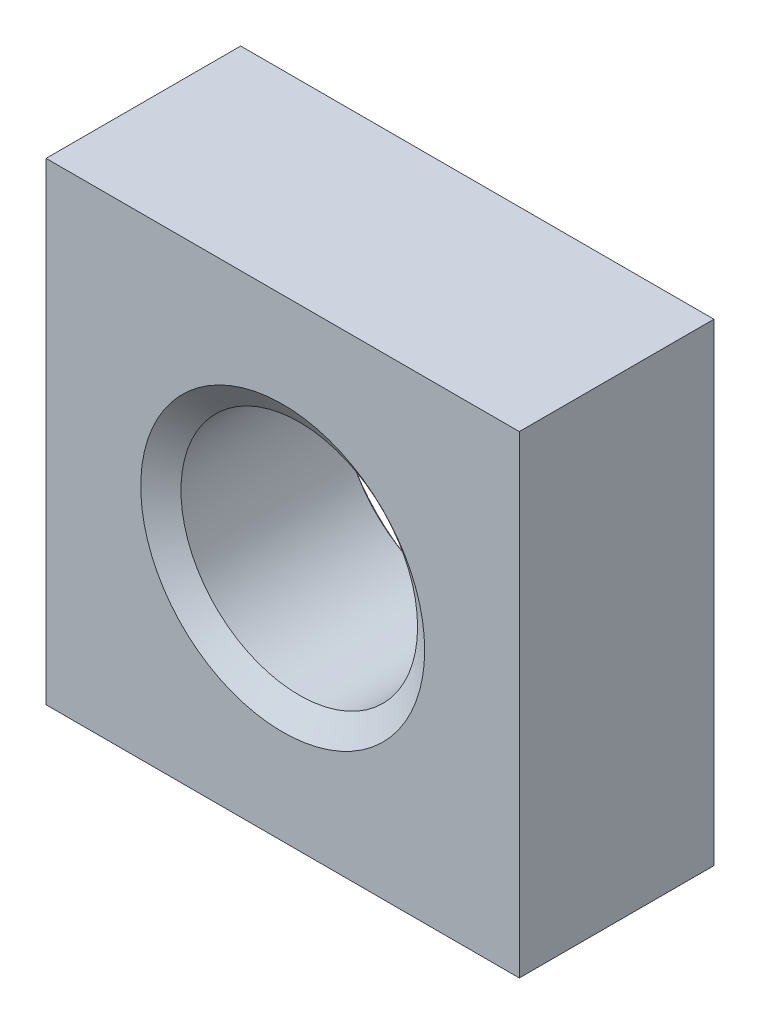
ISO-10303-21;
HEADER;
FILE_DESCRIPTION(('STEP AP214'),'2;1');
FILE_NAME('part.step','',(''),(''),'','','');
FILE_SCHEMA(('AUTOMOTIVE_DESIGN { 1 0 10303 214 1 1 1 1 }'));
ENDSEC;
DATA;
#1=APPLICATION_CONTEXT('core data for automotive mechanical design processes');
#2=APPLICATION_PROTOCOL_DEFINITION('international standard','automotive_design',2000,#1);
#3=PRODUCT_CONTEXT('',#1,'mechanical');
#4=PRODUCT('Part','Part','',(#3));
#5=PRODUCT_RELATED_PRODUCT_CATEGORY('part','',(#4));
#6=PRODUCT_DEFINITION_FORMATION('','',#4);
#7=PRODUCT_DEFINITION_CONTEXT('part definition',#1,'design');
#8=PRODUCT_DEFINITION('design','',#6,#7);
#9=PRODUCT_DEFINITION_SHAPE('','',#8);
#10=(LENGTH_UNIT() NAMED_UNIT(*) SI_UNIT(.MILLI.,.METRE.));
#11=(NAMED_UNIT(*) PLANE_ANGLE_UNIT() SI_UNIT($,.RADIAN.));
#12=(NAMED_UNIT(*) SI_UNIT($,.STERADIAN.) SOLID_ANGLE_UNIT());
#13=UNCERTAINTY_MEASURE_WITH_UNIT(LENGTH_MEASURE(1.E-05),#10,'distance_accuracy_value','');
#14=(GEOMETRIC_REPRESENTATION_CONTEXT(3) GLOBAL_UNCERTAINTY_ASSIGNED_CONTEXT((#13)) GLOBAL_UNIT_ASSIGNED_CONTEXT((#10,
#11,#12)) REPRESENTATION_CONTEXT('',''));
#15=CARTESIAN_POINT('',(0.,0.,0.));
#16=DIRECTION('',(0.,0.,1.));
#17=DIRECTION('',(1.,0.,0.));
#18=AXIS2_PLACEMENT_3D('',#15,#16,#17);
#19=CARTESIAN_POINT('',(0.,0.,-6.5278));
#20=DIRECTION('',(0.,0.,1.));
#21=DIRECTION('',(1.,0.,0.));
#22=AXIS2_PLACEMENT_3D('',#19,#20,#21);
#23=CYLINDRICAL_SURFACE('',#22,3.96875);
#24=CARTESIAN_POINT('',(0.,0.,-0.555789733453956));
#25=DIRECTION('',(0.,0.,1.));
#26=DIRECTION('',(1.,0.,0.));
#27=AXIS2_PLACEMENT_3D('',#24,#25,#26);
#28=CIRCLE('',#27,3.96875);
#29=CARTESIAN_POINT('',(3.96875,0.,-0.555789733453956));
#30=VERTEX_POINT('',#29);
#31=EDGE_CURVE('E111',#30,#30,#28,.F.);
#32=CARTESIAN_POINT('',(0.,0.,-5.94661026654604));
#33=DIRECTION('',(0.,0.,-1.));
#34=DIRECTION('',(-1.,0.,0.));
#35=AXIS2_PLACEMENT_3D('',#32,#33,#34);
#36=CIRCLE('',#35,3.96875);
#37=CARTESIAN_POINT('',(3.96875,0.,-5.94661026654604));
#38=VERTEX_POINT('',#37);
#39=EDGE_CURVE('E43',#38,#38,#36,.F.);
#40=CARTESIAN_POINT('',(3.96875,0.,-0.555789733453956));
#41=CARTESIAN_POINT('',(3.96875,0.,-0.611944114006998));
#42=CARTESIAN_POINT('',(3.96875,0.,-0.668098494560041));
#43=CARTESIAN_POINT('',(3.96875,0.,-0.780407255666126));
#44=CARTESIAN_POINT('',(3.96875,0.,-0.836561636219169));
#45=CARTESIAN_POINT('',(3.96875,0.,-0.948870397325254));
#46=CARTESIAN_POINT('',(3.96875,0.,-1.0050247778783));
#47=CARTESIAN_POINT('',(3.96875,0.,-1.11733353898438));
#48=CARTESIAN_POINT('',(3.96875,0.,-1.17348791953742));
#49=CARTESIAN_POINT('',(3.96875,0.,-1.28579668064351));
#50=CARTESIAN_POINT('',(3.96875,0.,-1.34195106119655));
#51=CARTESIAN_POINT('',(3.96875,0.,-1.45425982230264));
#52=CARTESIAN_POINT('',(3.96875,0.,-1.51041420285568));
#53=CARTESIAN_POINT('',(3.96875,0.,-1.62272296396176));
#54=CARTESIAN_POINT('',(3.96875,0.,-1.67887734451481));
#55=CARTESIAN_POINT('',(3.96875,0.,-1.79118610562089));
#56=CARTESIAN_POINT('',(3.96875,0.,-1.84734048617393));
#57=CARTESIAN_POINT('',(3.96875,0.,-1.95964924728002));
#58=CARTESIAN_POINT('',(3.96875,0.,-2.01580362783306));
#59=CARTESIAN_POINT('',(3.96875,0.,-2.12811238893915));
#60=CARTESIAN_POINT('',(3.96875,0.,-2.18426676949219));
#61=CARTESIAN_POINT('',(3.96875,0.,-2.29657553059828));
#62=CARTESIAN_POINT('',(3.96875,0.,-2.35272991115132));
#63=CARTESIAN_POINT('',(3.96875,0.,-2.4650386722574));
#64=CARTESIAN_POINT('',(3.96875,0.,-2.52119305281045));
#65=CARTESIAN_POINT('',(3.96875,0.,-2.63350181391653));
#66=CARTESIAN_POINT('',(3.96875,0.,-2.68965619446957));
#67=CARTESIAN_POINT('',(3.96875,0.,-2.80196495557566));
#68=CARTESIAN_POINT('',(3.96875,0.,-2.8581193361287));
#69=CARTESIAN_POINT('',(3.96875,0.,-2.97042809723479));
#70=CARTESIAN_POINT('',(3.96875,0.,-3.02658247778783));
#71=CARTESIAN_POINT('',(3.96875,0.,-3.13889123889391));
#72=CARTESIAN_POINT('',(3.96875,0.,-3.19504561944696));
#73=CARTESIAN_POINT('',(3.96875,0.,-3.30735438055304));
#74=CARTESIAN_POINT('',(3.96875,0.,-3.36350876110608));
#75=CARTESIAN_POINT('',(3.96875,0.,-3.47581752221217));
#76=CARTESIAN_POINT('',(3.96875,0.,-3.53197190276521));
#77=CARTESIAN_POINT('',(3.96875,0.,-3.6442806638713));
#78=CARTESIAN_POINT('',(3.96875,0.,-3.70043504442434));
#79=CARTESIAN_POINT('',(3.96875,0.,-3.81274380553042));
#80=CARTESIAN_POINT('',(3.96875,0.,-3.86889818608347));
#81=CARTESIAN_POINT('',(3.96875,0.,-3.98120694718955));
#82=CARTESIAN_POINT('',(3.96875,0.,-4.03736132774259));
#83=CARTESIAN_POINT('',(3.96875,0.,-4.14967008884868));
#84=CARTESIAN_POINT('',(3.96875,0.,-4.20582446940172));
#85=CARTESIAN_POINT('',(3.96875,0.,-4.31813323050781));
#86=CARTESIAN_POINT('',(3.96875,0.,-4.37428761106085));
#87=CARTESIAN_POINT('',(3.96875,0.,-4.48659637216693));
#88=CARTESIAN_POINT('',(3.96875,0.,-4.54275075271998));
#89=CARTESIAN_POINT('',(3.96875,0.,-4.65505951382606));
#90=CARTESIAN_POINT('',(3.96875,0.,-4.7112138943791));
#91=CARTESIAN_POINT('',(3.96875,0.,-4.82352265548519));
#92=CARTESIAN_POINT('',(3.96875,0.,-4.87967703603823));
#93=CARTESIAN_POINT('',(3.96875,0.,-4.99198579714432));
#94=CARTESIAN_POINT('',(3.96875,0.,-5.04814017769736));
#95=CARTESIAN_POINT('',(3.96875,0.,-5.16044893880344));
#96=CARTESIAN_POINT('',(3.96875,0.,-5.21660331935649));
#97=CARTESIAN_POINT('',(3.96875,0.,-5.32891208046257));
#98=CARTESIAN_POINT('',(3.96875,0.,-5.38506646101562));
#99=CARTESIAN_POINT('',(3.96875,0.,-5.4973752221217));
#100=CARTESIAN_POINT('',(3.96875,0.,-5.55352960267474));
#101=CARTESIAN_POINT('',(3.96875,0.,-5.66583836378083));
#102=CARTESIAN_POINT('',(3.96875,0.,-5.72199274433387));
#103=CARTESIAN_POINT('',(3.96875,0.,-5.83430150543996));
#104=CARTESIAN_POINT('',(3.96875,0.,-5.890455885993));
#105=CARTESIAN_POINT('',(3.96875,0.,-5.94661026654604));
#106=B_SPLINE_CURVE_WITH_KNOTS('',3,(#40,#41,#42,#43,#44,#45,#46,#47,#48,#49,#50,#51,#52,#53,
#54,#55,#56,#57,#58,#59,#60,#61,#62,#63,#64,#65,#66,#67,#68,#69,#70,#71,#72,#73,#74,#75,#76,#77,
#78,#79,#80,#81,#82,#83,#84,#85,#86,#87,#88,#89,#90,#91,#92,#93,#94,#95,#96,#97,#98,#99,#100,
#101,#102,#103,#104,#105),.UNSPECIFIED.,.F.,.F.,(4,2,2,2,2,2,2,2,2,2,2,2,2,2,2,2,2,2,2,2,2,2,2,
2,2,2,2,2,2,2,2,2,4),(0.,0.168463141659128,0.336926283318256,0.505389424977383,
0.673852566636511,0.842315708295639,1.01077884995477,1.17924199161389,1.34770513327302,
1.51616827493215,1.68463141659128,1.8530945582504,2.02155769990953,2.19002084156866,
2.35848398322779,2.52694712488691,2.69541026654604,2.86387340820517,3.0323365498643,
3.20079969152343,3.36926283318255,3.53772597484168,3.70618911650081,3.87465225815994,
4.04311539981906,4.21157854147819,4.38004168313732,4.54850482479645,4.71696796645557,
4.8854311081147,5.05389424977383,5.22235739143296,5.39082053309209),.UNSPECIFIED.);
#107=EDGE_CURVE('BSEAM39',#30,#38,#106,.T.);
#108=ORIENTED_EDGE('',*,*,#31,.F.);
#109=ORIENTED_EDGE('',*,*,#39,.F.);
#110=ORIENTED_EDGE('',*,*,#107,.T.);
#111=ORIENTED_EDGE('',*,*,#107,.F.);
#112=EDGE_LOOP('',(#108,#110,#109,#111));
#113=FACE_BOUND('',#112,.T.);
#114=ADVANCED_FACE('F39',(#113),#23,.F.);
#115=CARTESIAN_POINT('',(-7.9375,-7.9375,-6.5278));
#116=DIRECTION('',(-1.,0.,0.));
#117=DIRECTION('',(0.,0.,1.));
#118=AXIS2_PLACEMENT_3D('',#115,#116,#117);
#119=PLANE('',#118);
#120=DIRECTION('',(0.,-1.,0.));
#121=VECTOR('',#120,1.);
#122=CARTESIAN_POINT('',(-7.9375,-7.9375,0.));
#123=LINE('',#122,#121);
#124=CARTESIAN_POINT('',(-7.9375,7.9375,0.));
#125=VERTEX_POINT('',#124);
#126=CARTESIAN_POINT('',(-7.9375,-7.9375,0.));
#127=VERTEX_POINT('',#126);
#128=EDGE_CURVE('E107',#125,#127,#123,.T.);
#129=ORIENTED_EDGE('',*,*,#128,.F.);
#130=DIRECTION('',(0.,0.,1.));
#131=VECTOR('',#130,1.);
#132=CARTESIAN_POINT('',(-7.9375,7.9375,-6.5278));
#133=LINE('',#132,#131);
#134=CARTESIAN_POINT('',(-7.9375,7.9375,-6.5278));
#135=VERTEX_POINT('',#134);
#136=EDGE_CURVE('E11',#135,#125,#133,.T.);
#137=ORIENTED_EDGE('',*,*,#136,.F.);
#138=DIRECTION('',(0.,-1.,0.));
#139=VECTOR('',#138,1.);
#140=CARTESIAN_POINT('',(-7.9375,-7.9375,-6.5278));
#141=LINE('',#140,#139);
#142=CARTESIAN_POINT('',(-7.9375,-7.9375,-6.5278));
#143=VERTEX_POINT('',#142);
#144=EDGE_CURVE('E100',#135,#143,#141,.T.);
#145=ORIENTED_EDGE('',*,*,#144,.T.);
#146=DIRECTION('',(0.,0.,1.));
#147=VECTOR('',#146,1.);
#148=CARTESIAN_POINT('',(-7.9375,-7.9375,-6.5278));
#149=LINE('',#148,#147);
#150=EDGE_CURVE('E83',#143,#127,#149,.T.);
#151=ORIENTED_EDGE('',*,*,#150,.T.);
#152=EDGE_LOOP('',(#129,#137,#145,#151));
#153=FACE_BOUND('',#152,.T.);
#154=ADVANCED_FACE('F41',(#153),#119,.T.);
#155=CARTESIAN_POINT('',(-7.9375,7.9375,-6.5278));
#156=DIRECTION('',(0.,1.,0.));
#157=DIRECTION('',(0.,0.,1.));
#158=AXIS2_PLACEMENT_3D('',#155,#156,#157);
#159=PLANE('',#158);
#160=DIRECTION('',(-1.,0.,0.));
#161=VECTOR('',#160,1.);
#162=CARTESIAN_POINT('',(-7.9375,7.9375,0.));
#163=LINE('',#162,#161);
#164=CARTESIAN_POINT('',(7.9375,7.9375,0.));
#165=VERTEX_POINT('',#164);
#166=EDGE_CURVE('E102',#165,#125,#163,.T.);
#167=ORIENTED_EDGE('',*,*,#166,.F.);
#168=DIRECTION('',(0.,0.,1.));
#169=VECTOR('',#168,1.);
#170=CARTESIAN_POINT('',(7.9375,7.9375,-6.5278));
#171=LINE('',#170,#169);
#172=CARTESIAN_POINT('',(7.9375,7.9375,-6.5278));
#173=VERTEX_POINT('',#172);
#174=EDGE_CURVE('E49',#173,#165,#171,.T.);
#175=ORIENTED_EDGE('',*,*,#174,.F.);
#176=DIRECTION('',(-1.,0.,0.));
#177=VECTOR('',#176,1.);
#178=CARTESIAN_POINT('',(-7.9375,7.9375,-6.5278));
#179=LINE('',#178,#177);
#180=EDGE_CURVE('E97',#173,#135,#179,.T.);
#181=ORIENTED_EDGE('',*,*,#180,.T.);
#182=ORIENTED_EDGE('',*,*,#136,.T.);
#183=EDGE_LOOP('',(#167,#175,#181,#182));
#184=FACE_BOUND('',#183,.T.);
#185=ADVANCED_FACE('F140',(#184),#159,.T.);
#186=CARTESIAN_POINT('',(7.9375,-7.9375,-6.5278));
#187=DIRECTION('',(1.,0.,0.));
#188=DIRECTION('',(0.,0.,-1.));
#189=AXIS2_PLACEMENT_3D('',#186,#187,#188);
#190=PLANE('',#189);
#191=DIRECTION('',(0.,1.,0.));
#192=VECTOR('',#191,1.);
#193=CARTESIAN_POINT('',(7.9375,-7.9375,0.));
#194=LINE('',#193,#192);
#195=CARTESIAN_POINT('',(7.9375,-7.9375,0.));
#196=VERTEX_POINT('',#195);
#197=EDGE_CURVE('E91',#196,#165,#194,.T.);
#198=ORIENTED_EDGE('',*,*,#197,.F.);
#199=DIRECTION('',(0.,0.,1.));
#200=VECTOR('',#199,1.);
#201=CARTESIAN_POINT('',(7.9375,-7.9375,-6.5278));
#202=LINE('',#201,#200);
#203=CARTESIAN_POINT('',(7.9375,-7.9375,-6.5278));
#204=VERTEX_POINT('',#203);
#205=EDGE_CURVE('E86',#204,#196,#202,.T.);
#206=ORIENTED_EDGE('',*,*,#205,.F.);
#207=DIRECTION('',(0.,1.,0.));
#208=VECTOR('',#207,1.);
#209=CARTESIAN_POINT('',(7.9375,-7.9375,-6.5278));
#210=LINE('',#209,#208);
#211=EDGE_CURVE('E89',#204,#173,#210,.T.);
#212=ORIENTED_EDGE('',*,*,#211,.T.);
#213=ORIENTED_EDGE('',*,*,#174,.T.);
#214=EDGE_LOOP('',(#198,#206,#212,#213));
#215=FACE_BOUND('',#214,.T.);
#216=ADVANCED_FACE('F88',(#215),#190,.T.);
#217=CARTESIAN_POINT('',(-7.9375,-7.9375,-6.5278));
#218=DIRECTION('',(0.,-1.,0.));
#219=DIRECTION('',(0.,0.,-1.));
#220=AXIS2_PLACEMENT_3D('',#217,#218,#219);
#221=PLANE('',#220);
#222=DIRECTION('',(1.,0.,0.));
#223=VECTOR('',#222,1.);
#224=CARTESIAN_POINT('',(-7.9375,-7.9375,0.));
#225=LINE('',#224,#223);
#226=EDGE_CURVE('E110',#127,#196,#225,.T.);
#227=ORIENTED_EDGE('',*,*,#226,.F.);
#228=ORIENTED_EDGE('',*,*,#150,.F.);
#229=DIRECTION('',(1.,0.,0.));
#230=VECTOR('',#229,1.);
#231=CARTESIAN_POINT('',(-7.9375,-7.9375,-6.5278));
#232=LINE('',#231,#230);
#233=EDGE_CURVE('E96',#143,#204,#232,.T.);
#234=ORIENTED_EDGE('',*,*,#233,.T.);
#235=ORIENTED_EDGE('',*,*,#205,.T.);
#236=EDGE_LOOP('',(#227,#228,#234,#235));
#237=FACE_BOUND('',#236,.T.);
#238=ADVANCED_FACE('F99',(#237),#221,.T.);
#239=CARTESIAN_POINT('',(-7.9375,7.9375,-6.5278));
#240=DIRECTION('',(0.,0.,-1.));
#241=DIRECTION('',(-1.,0.,0.));
#242=AXIS2_PLACEMENT_3D('',#239,#240,#241);
#243=PLANE('',#242);
#244=CARTESIAN_POINT('',(0.,0.,-6.5278));
#245=DIRECTION('',(0.,0.,-1.));
#246=DIRECTION('',(-1.,0.,0.));
#247=AXIS2_PLACEMENT_3D('',#244,#245,#246);
#248=CIRCLE('',#247,4.7625);
#249=CARTESIAN_POINT('',(-4.7625,0.,-6.5278));
#250=VERTEX_POINT('',#249);
#251=EDGE_CURVE('E120',#250,#250,#248,.F.);
#252=ORIENTED_EDGE('',*,*,#251,.T.);
#253=EDGE_LOOP('',(#252));
#254=FACE_BOUND('',#253,.T.);
#255=ORIENTED_EDGE('',*,*,#144,.F.);
#256=ORIENTED_EDGE('',*,*,#180,.F.);
#257=ORIENTED_EDGE('',*,*,#211,.F.);
#258=ORIENTED_EDGE('',*,*,#233,.F.);
#259=EDGE_LOOP('',(#255,#256,#257,#258));
#260=FACE_BOUND('',#259,.T.);
#261=ADVANCED_FACE('F95',(#254,#260),#243,.T.);
#262=CARTESIAN_POINT('',(-7.9375,7.9375,0.));
#263=DIRECTION('',(0.,0.,-1.));
#264=DIRECTION('',(-1.,0.,0.));
#265=AXIS2_PLACEMENT_3D('',#262,#263,#264);
#266=PLANE('',#265);
#267=CARTESIAN_POINT('',(0.,0.,0.));
#268=DIRECTION('',(0.,0.,1.));
#269=DIRECTION('',(1.,0.,0.));
#270=AXIS2_PLACEMENT_3D('',#267,#268,#269);
#271=CIRCLE('',#270,4.7625);
#272=CARTESIAN_POINT('',(4.7625,0.,0.));
#273=VERTEX_POINT('',#272);
#274=EDGE_CURVE('E119',#273,#273,#271,.T.);
#275=ORIENTED_EDGE('',*,*,#274,.F.);
#276=EDGE_LOOP('',(#275));
#277=FACE_BOUND('',#276,.T.);
#278=ORIENTED_EDGE('',*,*,#128,.T.);
#279=ORIENTED_EDGE('',*,*,#226,.T.);
#280=ORIENTED_EDGE('',*,*,#197,.T.);
#281=ORIENTED_EDGE('',*,*,#166,.T.);
#282=EDGE_LOOP('',(#278,#279,#280,#281));
#283=FACE_BOUND('',#282,.T.);
#284=ADVANCED_FACE('F136',(#277,#283),#266,.F.);
#285=CARTESIAN_POINT('',(0.,0.,-0.611368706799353));
#286=DIRECTION('',(0.,0.,1.));
#287=DIRECTION('',(1.,0.,0.));
#288=AXIS2_PLACEMENT_3D('',#285,#286,#287);
#289=CONICAL_SURFACE('',#288,3.889375,0.959931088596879);
#290=ORIENTED_EDGE('',*,*,#274,.T.);
#291=EDGE_LOOP('',(#290));
#292=FACE_BOUND('',#291,.T.);
#293=ORIENTED_EDGE('',*,*,#31,.T.);
#294=EDGE_LOOP('',(#293));
#295=FACE_BOUND('',#294,.T.);
#296=ADVANCED_FACE('F133',(#292,#295),#289,.F.);
#297=CARTESIAN_POINT('',(0.,0.,-6.5024));
#298=DIRECTION('',(0.,0.,-1.));
#299=DIRECTION('',(-1.,0.,0.));
#300=AXIS2_PLACEMENT_3D('',#297,#298,#299);
#301=CONICAL_SURFACE('',#300,4.7625,0.959931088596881);
#302=CARTESIAN_POINT('',(0.,0.,-6.5024));
#303=DIRECTION('',(0.,0.,1.));
#304=DIRECTION('',(1.,0.,0.));
#305=AXIS2_PLACEMENT_3D('',#302,#303,#304);
#306=CIRCLE('',#305,4.7625);
#307=CARTESIAN_POINT('',(4.7625,0.,-6.5024));
#308=VERTEX_POINT('',#307);
#309=EDGE_CURVE('E122',#308,#308,#306,.T.);
#310=ORIENTED_EDGE('',*,*,#309,.F.);
#311=EDGE_LOOP('',(#310));
#312=FACE_BOUND('',#311,.T.);
#313=ORIENTED_EDGE('',*,*,#39,.T.);
#314=EDGE_LOOP('',(#313));
#315=FACE_BOUND('',#314,.T.);
#316=ADVANCED_FACE('F202',(#312,#315),#301,.F.);
#317=CARTESIAN_POINT('',(0.,0.,-25.0375057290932));
#318=DIRECTION('',(0.,0.,1.));
#319=DIRECTION('',(1.,0.,0.));
#320=AXIS2_PLACEMENT_3D('',#317,#318,#319);
#321=CYLINDRICAL_SURFACE('',#320,4.7625);
#322=ORIENTED_EDGE('',*,*,#251,.F.);
#323=EDGE_LOOP('',(#322));
#324=FACE_BOUND('',#323,.T.);
#325=ORIENTED_EDGE('',*,*,#309,.T.);
#326=EDGE_LOOP('',(#325));
#327=FACE_BOUND('',#326,.T.);
#328=ADVANCED_FACE('F209',(#324,#327),#321,.F.);
#329=CLOSED_SHELL('',(#114,#154,#185,#216,#238,#261,#284,#296,#316,#328));
#330=MANIFOLD_SOLID_BREP('B2',#329);
#331=ADVANCED_BREP_SHAPE_REPRESENTATION('',(#18,#330),#14);
#332=SHAPE_DEFINITION_REPRESENTATION(#9,#331);
ENDSEC;
END-ISO-10303-21;
